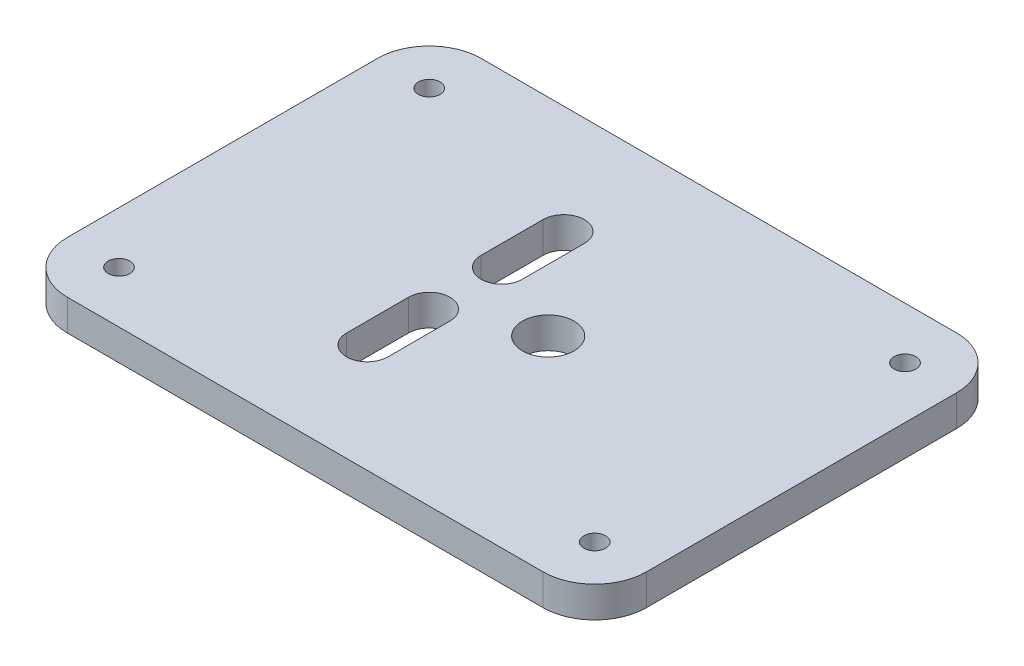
ISO-10303-21;
HEADER;
FILE_DESCRIPTION(('STEP AP214'),'2;1');
FILE_NAME('part.step','',(''),(''),'','','');
FILE_SCHEMA(('AUTOMOTIVE_DESIGN { 1 0 10303 214 1 1 1 1 }'));
ENDSEC;
DATA;
#1=APPLICATION_CONTEXT('core data for automotive mechanical design processes');
#2=APPLICATION_PROTOCOL_DEFINITION('international standard','automotive_design',2000,#1);
#3=PRODUCT_CONTEXT('',#1,'mechanical');
#4=PRODUCT('Part','Part','',(#3));
#5=PRODUCT_RELATED_PRODUCT_CATEGORY('part','',(#4));
#6=PRODUCT_DEFINITION_FORMATION('','',#4);
#7=PRODUCT_DEFINITION_CONTEXT('part definition',#1,'design');
#8=PRODUCT_DEFINITION('design','',#6,#7);
#9=PRODUCT_DEFINITION_SHAPE('','',#8);
#10=(LENGTH_UNIT() NAMED_UNIT(*) SI_UNIT(.MILLI.,.METRE.));
#11=(NAMED_UNIT(*) PLANE_ANGLE_UNIT() SI_UNIT($,.RADIAN.));
#12=(NAMED_UNIT(*) SI_UNIT($,.STERADIAN.) SOLID_ANGLE_UNIT());
#13=UNCERTAINTY_MEASURE_WITH_UNIT(LENGTH_MEASURE(1.E-05),#10,'distance_accuracy_value','');
#14=(GEOMETRIC_REPRESENTATION_CONTEXT(3) GLOBAL_UNCERTAINTY_ASSIGNED_CONTEXT((#13)) GLOBAL_UNIT_ASSIGNED_CONTEXT((#10,
#11,#12)) REPRESENTATION_CONTEXT('',''));
#15=CARTESIAN_POINT('',(0.,0.,0.));
#16=DIRECTION('',(0.,0.,1.));
#17=DIRECTION('',(1.,0.,0.));
#18=AXIS2_PLACEMENT_3D('',#15,#16,#17);
#19=CARTESIAN_POINT('',(102.,6.,-70.));
#20=DIRECTION('',(0.,1.,0.));
#21=DIRECTION('',(0.,0.,1.));
#22=AXIS2_PLACEMENT_3D('',#19,#20,#21);
#23=PLANE('',#22);
#24=CARTESIAN_POINT('',(10.,6.,-70.));
#25=DIRECTION('',(0.,1.,0.));
#26=DIRECTION('',(0.,0.,1.));
#27=AXIS2_PLACEMENT_3D('',#24,#25,#26);
#28=CIRCLE('',#27,2.09999999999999);
#29=CARTESIAN_POINT('',(10.,6.,-67.9));
#30=VERTEX_POINT('',#29);
#31=EDGE_CURVE('E474',#30,#30,#28,.T.);
#32=ORIENTED_EDGE('',*,*,#31,.F.);
#33=EDGE_LOOP('',(#32));
#34=FACE_BOUND('',#33,.T.);
#35=CARTESIAN_POINT('',(102.,6.,-70.));
#36=DIRECTION('',(0.,1.,0.));
#37=DIRECTION('',(0.,0.,1.));
#38=AXIS2_PLACEMENT_3D('',#35,#36,#37);
#39=CIRCLE('',#38,2.09999999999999);
#40=CARTESIAN_POINT('',(102.,6.,-67.9));
#41=VERTEX_POINT('',#40);
#42=EDGE_CURVE('E476',#41,#41,#39,.T.);
#43=ORIENTED_EDGE('',*,*,#42,.F.);
#44=EDGE_LOOP('',(#43));
#45=FACE_BOUND('',#44,.T.);
#46=CARTESIAN_POINT('',(102.,6.,-10.));
#47=DIRECTION('',(0.,1.,0.));
#48=DIRECTION('',(0.,0.,1.));
#49=AXIS2_PLACEMENT_3D('',#46,#47,#48);
#50=CIRCLE('',#49,2.09999999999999);
#51=CARTESIAN_POINT('',(102.,6.,-7.90000000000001));
#52=VERTEX_POINT('',#51);
#53=EDGE_CURVE('E484',#52,#52,#50,.T.);
#54=ORIENTED_EDGE('',*,*,#53,.F.);
#55=EDGE_LOOP('',(#54));
#56=FACE_BOUND('',#55,.T.);
#57=CARTESIAN_POINT('',(10.,6.,-10.));
#58=DIRECTION('',(0.,1.,0.));
#59=DIRECTION('',(0.,0.,1.));
#60=AXIS2_PLACEMENT_3D('',#57,#58,#59);
#61=CIRCLE('',#60,2.09999999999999);
#62=CARTESIAN_POINT('',(10.,6.,-7.90000000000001));
#63=VERTEX_POINT('',#62);
#64=EDGE_CURVE('E490',#63,#63,#61,.T.);
#65=ORIENTED_EDGE('',*,*,#64,.F.);
#66=EDGE_LOOP('',(#65));
#67=FACE_BOUND('',#66,.T.);
#68=DIRECTION('',(0.,0.,1.));
#69=VECTOR('',#68,1.);
#70=CARTESIAN_POINT('',(43.,6.,-47.));
#71=LINE('',#70,#69);
#72=CARTESIAN_POINT('',(43.,6.,-59.));
#73=VERTEX_POINT('',#72);
#74=CARTESIAN_POINT('',(43.,6.,-47.));
#75=VERTEX_POINT('',#74);
#76=EDGE_CURVE('E184',#73,#75,#71,.T.);
#77=ORIENTED_EDGE('',*,*,#76,.F.);
#78=CARTESIAN_POINT('',(47.,6.,-59.));
#79=DIRECTION('',(0.,1.,0.));
#80=DIRECTION('',(0.,0.,1.));
#81=AXIS2_PLACEMENT_3D('',#78,#79,#80);
#82=CIRCLE('',#81,4.);
#83=CARTESIAN_POINT('',(51.,6.,-59.));
#84=VERTEX_POINT('',#83);
#85=EDGE_CURVE('E182',#84,#73,#82,.T.);
#86=ORIENTED_EDGE('',*,*,#85,.F.);
#87=DIRECTION('',(0.,0.,-1.));
#88=VECTOR('',#87,1.);
#89=CARTESIAN_POINT('',(51.,6.,-59.));
#90=LINE('',#89,#88);
#91=CARTESIAN_POINT('',(51.,6.,-47.));
#92=VERTEX_POINT('',#91);
#93=EDGE_CURVE('E190',#92,#84,#90,.T.);
#94=ORIENTED_EDGE('',*,*,#93,.F.);
#95=CARTESIAN_POINT('',(47.,6.,-47.));
#96=DIRECTION('',(0.,1.,0.));
#97=DIRECTION('',(0.,0.,1.));
#98=AXIS2_PLACEMENT_3D('',#95,#96,#97);
#99=CIRCLE('',#98,4.);
#100=EDGE_CURVE('E187',#75,#92,#99,.T.);
#101=ORIENTED_EDGE('',*,*,#100,.F.);
#102=EDGE_LOOP('',(#77,#86,#94,#101));
#103=FACE_BOUND('',#102,.T.);
#104=CARTESIAN_POINT('',(102.,6.,-70.));
#105=DIRECTION('',(0.,1.,0.));
#106=DIRECTION('',(0.,0.,1.));
#107=AXIS2_PLACEMENT_3D('',#104,#105,#106);
#108=CIRCLE('',#107,9.99999999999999);
#109=CARTESIAN_POINT('',(112.,6.,-69.9999999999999));
#110=VERTEX_POINT('',#109);
#111=CARTESIAN_POINT('',(102.,6.,-80.));
#112=VERTEX_POINT('',#111);
#113=EDGE_CURVE('E219',#110,#112,#108,.T.);
#114=ORIENTED_EDGE('',*,*,#113,.T.);
#115=DIRECTION('',(-1.,0.,0.));
#116=VECTOR('',#115,1.);
#117=CARTESIAN_POINT('',(10.0000000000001,6.,-80.));
#118=LINE('',#117,#116);
#119=CARTESIAN_POINT('',(10.0000000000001,6.,-80.));
#120=VERTEX_POINT('',#119);
#121=EDGE_CURVE('E222',#112,#120,#118,.T.);
#122=ORIENTED_EDGE('',*,*,#121,.T.);
#123=CARTESIAN_POINT('',(10.,6.,-70.));
#124=DIRECTION('',(0.,1.,0.));
#125=DIRECTION('',(0.,0.,-1.));
#126=AXIS2_PLACEMENT_3D('',#123,#124,#125);
#127=CIRCLE('',#126,10.);
#128=CARTESIAN_POINT('',(0.,6.,-69.9999999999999));
#129=VERTEX_POINT('',#128);
#130=EDGE_CURVE('E225',#120,#129,#127,.T.);
#131=ORIENTED_EDGE('',*,*,#130,.T.);
#132=DIRECTION('',(0.,0.,1.));
#133=VECTOR('',#132,1.);
#134=CARTESIAN_POINT('',(0.,6.,-10.0000000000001));
#135=LINE('',#134,#133);
#136=CARTESIAN_POINT('',(0.,6.,-10.0000000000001));
#137=VERTEX_POINT('',#136);
#138=EDGE_CURVE('E227',#129,#137,#135,.T.);
#139=ORIENTED_EDGE('',*,*,#138,.T.);
#140=CARTESIAN_POINT('',(10.,6.,-10.));
#141=DIRECTION('',(0.,1.,0.));
#142=DIRECTION('',(0.,0.,-1.));
#143=AXIS2_PLACEMENT_3D('',#140,#141,#142);
#144=CIRCLE('',#143,10.);
#145=CARTESIAN_POINT('',(10.0000000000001,6.,0.));
#146=VERTEX_POINT('',#145);
#147=EDGE_CURVE('E229',#137,#146,#144,.T.);
#148=ORIENTED_EDGE('',*,*,#147,.T.);
#149=DIRECTION('',(1.,0.,0.));
#150=VECTOR('',#149,1.);
#151=CARTESIAN_POINT('',(10.0000000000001,6.,0.));
#152=LINE('',#151,#150);
#153=CARTESIAN_POINT('',(102.,6.,0.));
#154=VERTEX_POINT('',#153);
#155=EDGE_CURVE('E231',#146,#154,#152,.T.);
#156=ORIENTED_EDGE('',*,*,#155,.T.);
#157=CARTESIAN_POINT('',(102.,6.,-10.));
#158=DIRECTION('',(0.,1.,0.));
#159=DIRECTION('',(0.,0.,1.));
#160=AXIS2_PLACEMENT_3D('',#157,#158,#159);
#161=CIRCLE('',#160,10.);
#162=CARTESIAN_POINT('',(112.,6.,-10.0000000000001));
#163=VERTEX_POINT('',#162);
#164=EDGE_CURVE('E233',#154,#163,#161,.T.);
#165=ORIENTED_EDGE('',*,*,#164,.T.);
#166=DIRECTION('',(0.,0.,-1.));
#167=VECTOR('',#166,1.);
#168=CARTESIAN_POINT('',(112.,6.,-10.0000000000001));
#169=LINE('',#168,#167);
#170=EDGE_CURVE('E235',#163,#110,#169,.T.);
#171=ORIENTED_EDGE('',*,*,#170,.T.);
#172=EDGE_LOOP('',(#114,#122,#131,#139,#148,#156,#165,#171));
#173=FACE_BOUND('',#172,.T.);
#174=CARTESIAN_POINT('',(63.,6.,-40.));
#175=DIRECTION('',(0.,1.,0.));
#176=DIRECTION('',(0.,0.,1.));
#177=AXIS2_PLACEMENT_3D('',#174,#175,#176);
#178=CIRCLE('',#177,5.00000000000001);
#179=CARTESIAN_POINT('',(63.,6.,-35.));
#180=VERTEX_POINT('',#179);
#181=EDGE_CURVE('E213',#180,#180,#178,.T.);
#182=ORIENTED_EDGE('',*,*,#181,.F.);
#183=EDGE_LOOP('',(#182));
#184=FACE_BOUND('',#183,.T.);
#185=DIRECTION('',(0.,0.,1.));
#186=VECTOR('',#185,1.);
#187=CARTESIAN_POINT('',(43.,6.,-21.));
#188=LINE('',#187,#186);
#189=CARTESIAN_POINT('',(43.,6.,-33.));
#190=VERTEX_POINT('',#189);
#191=CARTESIAN_POINT('',(43.,6.,-21.));
#192=VERTEX_POINT('',#191);
#193=EDGE_CURVE('E152',#190,#192,#188,.T.);
#194=ORIENTED_EDGE('',*,*,#193,.F.);
#195=CARTESIAN_POINT('',(47.,6.,-33.));
#196=DIRECTION('',(0.,1.,0.));
#197=DIRECTION('',(0.,0.,1.));
#198=AXIS2_PLACEMENT_3D('',#195,#196,#197);
#199=CIRCLE('',#198,4.);
#200=CARTESIAN_POINT('',(51.,6.,-33.));
#201=VERTEX_POINT('',#200);
#202=EDGE_CURVE('E144',#201,#190,#199,.T.);
#203=ORIENTED_EDGE('',*,*,#202,.F.);
#204=DIRECTION('',(0.,0.,-1.));
#205=VECTOR('',#204,1.);
#206=CARTESIAN_POINT('',(51.,6.,-33.));
#207=LINE('',#206,#205);
#208=CARTESIAN_POINT('',(51.,6.,-21.));
#209=VERTEX_POINT('',#208);
#210=EDGE_CURVE('E166',#209,#201,#207,.T.);
#211=ORIENTED_EDGE('',*,*,#210,.F.);
#212=CARTESIAN_POINT('',(47.,6.,-21.));
#213=DIRECTION('',(0.,1.,0.));
#214=DIRECTION('',(0.,0.,1.));
#215=AXIS2_PLACEMENT_3D('',#212,#213,#214);
#216=CIRCLE('',#215,4.);
#217=EDGE_CURVE('E164',#192,#209,#216,.T.);
#218=ORIENTED_EDGE('',*,*,#217,.F.);
#219=EDGE_LOOP('',(#194,#203,#211,#218));
#220=FACE_BOUND('',#219,.T.);
#221=ADVANCED_FACE('F31',(#34,#45,#56,#67,#103,#173,#184,#220),#23,.T.);
#222=CARTESIAN_POINT('',(102.,0.,-70.));
#223=DIRECTION('',(0.,1.,0.));
#224=DIRECTION('',(0.,0.,1.));
#225=AXIS2_PLACEMENT_3D('',#222,#223,#224);
#226=PLANE('',#225);
#227=CARTESIAN_POINT('',(10.,0.,-70.));
#228=DIRECTION('',(0.,1.,0.));
#229=DIRECTION('',(0.,0.,1.));
#230=AXIS2_PLACEMENT_3D('',#227,#228,#229);
#231=CIRCLE('',#230,2.1);
#232=CARTESIAN_POINT('',(10.,0.,-67.9));
#233=VERTEX_POINT('',#232);
#234=EDGE_CURVE('E472',#233,#233,#231,.T.);
#235=ORIENTED_EDGE('',*,*,#234,.T.);
#236=EDGE_LOOP('',(#235));
#237=FACE_BOUND('',#236,.T.);
#238=CARTESIAN_POINT('',(102.,0.,-70.));
#239=DIRECTION('',(0.,1.,0.));
#240=DIRECTION('',(0.,0.,1.));
#241=AXIS2_PLACEMENT_3D('',#238,#239,#240);
#242=CIRCLE('',#241,2.09999999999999);
#243=CARTESIAN_POINT('',(102.,0.,-67.9));
#244=VERTEX_POINT('',#243);
#245=EDGE_CURVE('E481',#244,#244,#242,.T.);
#246=ORIENTED_EDGE('',*,*,#245,.T.);
#247=EDGE_LOOP('',(#246));
#248=FACE_BOUND('',#247,.T.);
#249=CARTESIAN_POINT('',(102.,0.,-10.));
#250=DIRECTION('',(0.,1.,0.));
#251=DIRECTION('',(0.,0.,1.));
#252=AXIS2_PLACEMENT_3D('',#249,#250,#251);
#253=CIRCLE('',#252,2.09999999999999);
#254=CARTESIAN_POINT('',(102.,0.,-7.90000000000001));
#255=VERTEX_POINT('',#254);
#256=EDGE_CURVE('E487',#255,#255,#253,.T.);
#257=ORIENTED_EDGE('',*,*,#256,.T.);
#258=EDGE_LOOP('',(#257));
#259=FACE_BOUND('',#258,.T.);
#260=CARTESIAN_POINT('',(10.,0.,-10.));
#261=DIRECTION('',(0.,1.,0.));
#262=DIRECTION('',(0.,0.,1.));
#263=AXIS2_PLACEMENT_3D('',#260,#261,#262);
#264=CIRCLE('',#263,2.1);
#265=CARTESIAN_POINT('',(10.,0.,-7.9));
#266=VERTEX_POINT('',#265);
#267=EDGE_CURVE('E172',#266,#266,#264,.T.);
#268=ORIENTED_EDGE('',*,*,#267,.T.);
#269=EDGE_LOOP('',(#268));
#270=FACE_BOUND('',#269,.T.);
#271=CARTESIAN_POINT('',(47.,0.,-59.));
#272=DIRECTION('',(0.,1.,0.));
#273=DIRECTION('',(0.,0.,1.));
#274=AXIS2_PLACEMENT_3D('',#271,#272,#273);
#275=CIRCLE('',#274,4.);
#276=CARTESIAN_POINT('',(51.,0.,-59.));
#277=VERTEX_POINT('',#276);
#278=CARTESIAN_POINT('',(43.,0.,-59.));
#279=VERTEX_POINT('',#278);
#280=EDGE_CURVE('E160',#277,#279,#275,.T.);
#281=ORIENTED_EDGE('',*,*,#280,.T.);
#282=DIRECTION('',(0.,0.,1.));
#283=VECTOR('',#282,1.);
#284=CARTESIAN_POINT('',(43.,0.,-47.));
#285=LINE('',#284,#283);
#286=CARTESIAN_POINT('',(43.,0.,-47.));
#287=VERTEX_POINT('',#286);
#288=EDGE_CURVE('E195',#279,#287,#285,.T.);
#289=ORIENTED_EDGE('',*,*,#288,.T.);
#290=CARTESIAN_POINT('',(47.,0.,-47.));
#291=DIRECTION('',(0.,1.,0.));
#292=DIRECTION('',(0.,0.,1.));
#293=AXIS2_PLACEMENT_3D('',#290,#291,#292);
#294=CIRCLE('',#293,4.);
#295=CARTESIAN_POINT('',(51.,0.,-47.));
#296=VERTEX_POINT('',#295);
#297=EDGE_CURVE('E198',#287,#296,#294,.T.);
#298=ORIENTED_EDGE('',*,*,#297,.T.);
#299=DIRECTION('',(0.,0.,-1.));
#300=VECTOR('',#299,1.);
#301=CARTESIAN_POINT('',(51.,0.,-59.));
#302=LINE('',#301,#300);
#303=EDGE_CURVE('E185',#296,#277,#302,.T.);
#304=ORIENTED_EDGE('',*,*,#303,.T.);
#305=EDGE_LOOP('',(#281,#289,#298,#304));
#306=FACE_BOUND('',#305,.T.);
#307=CARTESIAN_POINT('',(102.,0.,-70.));
#308=DIRECTION('',(0.,1.,0.));
#309=DIRECTION('',(0.,0.,1.));
#310=AXIS2_PLACEMENT_3D('',#307,#308,#309);
#311=CIRCLE('',#310,9.99999999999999);
#312=CARTESIAN_POINT('',(112.,0.,-69.9999999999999));
#313=VERTEX_POINT('',#312);
#314=CARTESIAN_POINT('',(102.,0.,-80.));
#315=VERTEX_POINT('',#314);
#316=EDGE_CURVE('E216',#313,#315,#311,.T.);
#317=ORIENTED_EDGE('',*,*,#316,.F.);
#318=DIRECTION('',(0.,0.,-1.));
#319=VECTOR('',#318,1.);
#320=CARTESIAN_POINT('',(112.,0.,-10.0000000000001));
#321=LINE('',#320,#319);
#322=CARTESIAN_POINT('',(112.,0.,-10.0000000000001));
#323=VERTEX_POINT('',#322);
#324=EDGE_CURVE('E223',#323,#313,#321,.T.);
#325=ORIENTED_EDGE('',*,*,#324,.F.);
#326=CARTESIAN_POINT('',(102.,0.,-10.));
#327=DIRECTION('',(0.,1.,0.));
#328=DIRECTION('',(0.,0.,1.));
#329=AXIS2_PLACEMENT_3D('',#326,#327,#328);
#330=CIRCLE('',#329,10.);
#331=CARTESIAN_POINT('',(102.,0.,0.));
#332=VERTEX_POINT('',#331);
#333=EDGE_CURVE('E250',#332,#323,#330,.T.);
#334=ORIENTED_EDGE('',*,*,#333,.F.);
#335=DIRECTION('',(1.,0.,0.));
#336=VECTOR('',#335,1.);
#337=CARTESIAN_POINT('',(10.0000000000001,0.,0.));
#338=LINE('',#337,#336);
#339=CARTESIAN_POINT('',(10.0000000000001,0.,0.));
#340=VERTEX_POINT('',#339);
#341=EDGE_CURVE('E248',#340,#332,#338,.T.);
#342=ORIENTED_EDGE('',*,*,#341,.F.);
#343=CARTESIAN_POINT('',(10.,0.,-10.));
#344=DIRECTION('',(0.,1.,0.));
#345=DIRECTION('',(0.,0.,-1.));
#346=AXIS2_PLACEMENT_3D('',#343,#344,#345);
#347=CIRCLE('',#346,10.);
#348=CARTESIAN_POINT('',(0.,0.,-10.0000000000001));
#349=VERTEX_POINT('',#348);
#350=EDGE_CURVE('E246',#349,#340,#347,.T.);
#351=ORIENTED_EDGE('',*,*,#350,.F.);
#352=DIRECTION('',(0.,0.,1.));
#353=VECTOR('',#352,1.);
#354=CARTESIAN_POINT('',(0.,0.,-10.0000000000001));
#355=LINE('',#354,#353);
#356=CARTESIAN_POINT('',(0.,0.,-69.9999999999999));
#357=VERTEX_POINT('',#356);
#358=EDGE_CURVE('E244',#357,#349,#355,.T.);
#359=ORIENTED_EDGE('',*,*,#358,.F.);
#360=CARTESIAN_POINT('',(10.,0.,-70.));
#361=DIRECTION('',(0.,1.,0.));
#362=DIRECTION('',(0.,0.,-1.));
#363=AXIS2_PLACEMENT_3D('',#360,#361,#362);
#364=CIRCLE('',#363,10.);
#365=CARTESIAN_POINT('',(10.0000000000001,0.,-80.));
#366=VERTEX_POINT('',#365);
#367=EDGE_CURVE('E242',#366,#357,#364,.T.);
#368=ORIENTED_EDGE('',*,*,#367,.F.);
#369=DIRECTION('',(-1.,0.,0.));
#370=VECTOR('',#369,1.);
#371=CARTESIAN_POINT('',(10.0000000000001,0.,-80.));
#372=LINE('',#371,#370);
#373=EDGE_CURVE('E240',#315,#366,#372,.T.);
#374=ORIENTED_EDGE('',*,*,#373,.F.);
#375=EDGE_LOOP('',(#317,#325,#334,#342,#351,#359,#368,#374));
#376=FACE_BOUND('',#375,.T.);
#377=CARTESIAN_POINT('',(63.,0.,-40.));
#378=DIRECTION('',(0.,1.,0.));
#379=DIRECTION('',(0.,0.,1.));
#380=AXIS2_PLACEMENT_3D('',#377,#378,#379);
#381=CIRCLE('',#380,5.00000000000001);
#382=CARTESIAN_POINT('',(63.,0.,-35.));
#383=VERTEX_POINT('',#382);
#384=EDGE_CURVE('E212',#383,#383,#381,.T.);
#385=ORIENTED_EDGE('',*,*,#384,.T.);
#386=EDGE_LOOP('',(#385));
#387=FACE_BOUND('',#386,.T.);
#388=CARTESIAN_POINT('',(47.,0.,-33.));
#389=DIRECTION('',(0.,1.,0.));
#390=DIRECTION('',(0.,0.,1.));
#391=AXIS2_PLACEMENT_3D('',#388,#389,#390);
#392=CIRCLE('',#391,4.);
#393=CARTESIAN_POINT('',(51.,0.,-33.));
#394=VERTEX_POINT('',#393);
#395=CARTESIAN_POINT('',(43.,0.,-33.));
#396=VERTEX_POINT('',#395);
#397=EDGE_CURVE('E54',#394,#396,#392,.T.);
#398=ORIENTED_EDGE('',*,*,#397,.T.);
#399=DIRECTION('',(0.,0.,1.));
#400=VECTOR('',#399,1.);
#401=CARTESIAN_POINT('',(43.,0.,-21.));
#402=LINE('',#401,#400);
#403=CARTESIAN_POINT('',(43.,0.,-21.));
#404=VERTEX_POINT('',#403);
#405=EDGE_CURVE('E159',#396,#404,#402,.T.);
#406=ORIENTED_EDGE('',*,*,#405,.T.);
#407=CARTESIAN_POINT('',(47.,0.,-21.));
#408=DIRECTION('',(0.,1.,0.));
#409=DIRECTION('',(0.,0.,1.));
#410=AXIS2_PLACEMENT_3D('',#407,#408,#409);
#411=CIRCLE('',#410,4.);
#412=CARTESIAN_POINT('',(51.,0.,-21.));
#413=VERTEX_POINT('',#412);
#414=EDGE_CURVE('E174',#404,#413,#411,.T.);
#415=ORIENTED_EDGE('',*,*,#414,.T.);
#416=DIRECTION('',(0.,0.,-1.));
#417=VECTOR('',#416,1.);
#418=CARTESIAN_POINT('',(51.,0.,-33.));
#419=LINE('',#418,#417);
#420=EDGE_CURVE('E153',#413,#394,#419,.T.);
#421=ORIENTED_EDGE('',*,*,#420,.T.);
#422=EDGE_LOOP('',(#398,#406,#415,#421));
#423=FACE_BOUND('',#422,.T.);
#424=ADVANCED_FACE('F280',(#237,#248,#259,#270,#306,#376,#387,#423),#226,.F.);
#425=CARTESIAN_POINT('',(102.,6.,-70.));
#426=DIRECTION('',(0.,-1.,0.));
#427=DIRECTION('',(0.,0.,-1.));
#428=AXIS2_PLACEMENT_3D('',#425,#426,#427);
#429=CYLINDRICAL_SURFACE('',#428,9.99999999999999);
#430=ORIENTED_EDGE('',*,*,#316,.T.);
#431=DIRECTION('',(0.,-1.,0.));
#432=VECTOR('',#431,1.);
#433=CARTESIAN_POINT('',(102.,6.,-80.));
#434=LINE('',#433,#432);
#435=EDGE_CURVE('E11',#112,#315,#434,.T.);
#436=ORIENTED_EDGE('',*,*,#435,.F.);
#437=ORIENTED_EDGE('',*,*,#113,.F.);
#438=DIRECTION('',(0.,-1.,0.));
#439=VECTOR('',#438,1.);
#440=CARTESIAN_POINT('',(112.,6.,-69.9999999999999));
#441=LINE('',#440,#439);
#442=EDGE_CURVE('E237',#110,#313,#441,.T.);
#443=ORIENTED_EDGE('',*,*,#442,.T.);
#444=EDGE_LOOP('',(#430,#436,#437,#443));
#445=FACE_BOUND('',#444,.T.);
#446=ADVANCED_FACE('F33',(#445),#429,.T.);
#447=CARTESIAN_POINT('',(10.0000000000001,6.,-80.));
#448=DIRECTION('',(0.,0.,1.));
#449=DIRECTION('',(1.,0.,0.));
#450=AXIS2_PLACEMENT_3D('',#447,#448,#449);
#451=PLANE('',#450);
#452=ORIENTED_EDGE('',*,*,#373,.T.);
#453=DIRECTION('',(0.,-1.,0.));
#454=VECTOR('',#453,1.);
#455=CARTESIAN_POINT('',(10.0000000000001,6.,-80.));
#456=LINE('',#455,#454);
#457=EDGE_CURVE('E39',#120,#366,#456,.T.);
#458=ORIENTED_EDGE('',*,*,#457,.F.);
#459=ORIENTED_EDGE('',*,*,#121,.F.);
#460=ORIENTED_EDGE('',*,*,#435,.T.);
#461=EDGE_LOOP('',(#452,#458,#459,#460));
#462=FACE_BOUND('',#461,.T.);
#463=ADVANCED_FACE('F298',(#462),#451,.F.);
#464=CARTESIAN_POINT('',(10.,6.,-70.));
#465=DIRECTION('',(0.,-1.,0.));
#466=DIRECTION('',(0.,0.,-1.));
#467=AXIS2_PLACEMENT_3D('',#464,#465,#466);
#468=CYLINDRICAL_SURFACE('',#467,10.);
#469=ORIENTED_EDGE('',*,*,#367,.T.);
#470=DIRECTION('',(0.,-1.,0.));
#471=VECTOR('',#470,1.);
#472=CARTESIAN_POINT('',(0.,6.,-69.9999999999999));
#473=LINE('',#472,#471);
#474=EDGE_CURVE('E267',#129,#357,#473,.T.);
#475=ORIENTED_EDGE('',*,*,#474,.F.);
#476=ORIENTED_EDGE('',*,*,#130,.F.);
#477=ORIENTED_EDGE('',*,*,#457,.T.);
#478=EDGE_LOOP('',(#469,#475,#476,#477));
#479=FACE_BOUND('',#478,.T.);
#480=ADVANCED_FACE('F274',(#479),#468,.T.);
#481=CARTESIAN_POINT('',(0.,6.,-10.0000000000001));
#482=DIRECTION('',(1.,0.,0.));
#483=DIRECTION('',(0.,0.,-1.));
#484=AXIS2_PLACEMENT_3D('',#481,#482,#483);
#485=PLANE('',#484);
#486=ORIENTED_EDGE('',*,*,#358,.T.);
#487=DIRECTION('',(0.,-1.,0.));
#488=VECTOR('',#487,1.);
#489=CARTESIAN_POINT('',(0.,6.,-10.0000000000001));
#490=LINE('',#489,#488);
#491=EDGE_CURVE('E264',#137,#349,#490,.T.);
#492=ORIENTED_EDGE('',*,*,#491,.F.);
#493=ORIENTED_EDGE('',*,*,#138,.F.);
#494=ORIENTED_EDGE('',*,*,#474,.T.);
#495=EDGE_LOOP('',(#486,#492,#493,#494));
#496=FACE_BOUND('',#495,.T.);
#497=ADVANCED_FACE('F286',(#496),#485,.F.);
#498=CARTESIAN_POINT('',(10.,6.,-10.));
#499=DIRECTION('',(0.,-1.,0.));
#500=DIRECTION('',(0.,0.,-1.));
#501=AXIS2_PLACEMENT_3D('',#498,#499,#500);
#502=CYLINDRICAL_SURFACE('',#501,10.);
#503=ORIENTED_EDGE('',*,*,#350,.T.);
#504=DIRECTION('',(0.,-1.,0.));
#505=VECTOR('',#504,1.);
#506=CARTESIAN_POINT('',(10.0000000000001,6.,0.));
#507=LINE('',#506,#505);
#508=EDGE_CURVE('E261',#146,#340,#507,.T.);
#509=ORIENTED_EDGE('',*,*,#508,.F.);
#510=ORIENTED_EDGE('',*,*,#147,.F.);
#511=ORIENTED_EDGE('',*,*,#491,.T.);
#512=EDGE_LOOP('',(#503,#509,#510,#511));
#513=FACE_BOUND('',#512,.T.);
#514=ADVANCED_FACE('F290',(#513),#502,.T.);
#515=CARTESIAN_POINT('',(10.0000000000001,6.,0.));
#516=DIRECTION('',(0.,0.,-1.));
#517=DIRECTION('',(-1.,0.,0.));
#518=AXIS2_PLACEMENT_3D('',#515,#516,#517);
#519=PLANE('',#518);
#520=ORIENTED_EDGE('',*,*,#341,.T.);
#521=DIRECTION('',(0.,-1.,0.));
#522=VECTOR('',#521,1.);
#523=CARTESIAN_POINT('',(102.,6.,0.));
#524=LINE('',#523,#522);
#525=EDGE_CURVE('E258',#154,#332,#524,.T.);
#526=ORIENTED_EDGE('',*,*,#525,.F.);
#527=ORIENTED_EDGE('',*,*,#155,.F.);
#528=ORIENTED_EDGE('',*,*,#508,.T.);
#529=EDGE_LOOP('',(#520,#526,#527,#528));
#530=FACE_BOUND('',#529,.T.);
#531=ADVANCED_FACE('F311',(#530),#519,.F.);
#532=CARTESIAN_POINT('',(102.,6.,-10.));
#533=DIRECTION('',(0.,-1.,0.));
#534=DIRECTION('',(0.,0.,-1.));
#535=AXIS2_PLACEMENT_3D('',#532,#533,#534);
#536=CYLINDRICAL_SURFACE('',#535,10.);
#537=ORIENTED_EDGE('',*,*,#333,.T.);
#538=DIRECTION('',(0.,-1.,0.));
#539=VECTOR('',#538,1.);
#540=CARTESIAN_POINT('',(112.,6.,-10.0000000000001));
#541=LINE('',#540,#539);
#542=EDGE_CURVE('E255',#163,#323,#541,.T.);
#543=ORIENTED_EDGE('',*,*,#542,.F.);
#544=ORIENTED_EDGE('',*,*,#164,.F.);
#545=ORIENTED_EDGE('',*,*,#525,.T.);
#546=EDGE_LOOP('',(#537,#543,#544,#545));
#547=FACE_BOUND('',#546,.T.);
#548=ADVANCED_FACE('F309',(#547),#536,.T.);
#549=CARTESIAN_POINT('',(112.,6.,-10.0000000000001));
#550=DIRECTION('',(-1.,0.,0.));
#551=DIRECTION('',(0.,0.,1.));
#552=AXIS2_PLACEMENT_3D('',#549,#550,#551);
#553=PLANE('',#552);
#554=ORIENTED_EDGE('',*,*,#324,.T.);
#555=ORIENTED_EDGE('',*,*,#442,.F.);
#556=ORIENTED_EDGE('',*,*,#170,.F.);
#557=ORIENTED_EDGE('',*,*,#542,.T.);
#558=EDGE_LOOP('',(#554,#555,#556,#557));
#559=FACE_BOUND('',#558,.T.);
#560=ADVANCED_FACE('F304',(#559),#553,.F.);
#561=CARTESIAN_POINT('',(63.,6.,-40.));
#562=DIRECTION('',(0.,-1.,0.));
#563=DIRECTION('',(0.,0.,-1.));
#564=AXIS2_PLACEMENT_3D('',#561,#562,#563);
#565=CYLINDRICAL_SURFACE('',#564,5.00000000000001);
#566=ORIENTED_EDGE('',*,*,#181,.T.);
#567=EDGE_LOOP('',(#566));
#568=FACE_BOUND('',#567,.T.);
#569=ORIENTED_EDGE('',*,*,#384,.F.);
#570=EDGE_LOOP('',(#569));
#571=FACE_BOUND('',#570,.T.);
#572=ADVANCED_FACE('F331',(#568,#571),#565,.F.);
#573=CARTESIAN_POINT('',(47.,6.,-59.));
#574=DIRECTION('',(0.,-1.,0.));
#575=DIRECTION('',(0.,0.,-1.));
#576=AXIS2_PLACEMENT_3D('',#573,#574,#575);
#577=CYLINDRICAL_SURFACE('',#576,4.);
#578=ORIENTED_EDGE('',*,*,#280,.F.);
#579=DIRECTION('',(0.,-1.,0.));
#580=VECTOR('',#579,1.);
#581=CARTESIAN_POINT('',(51.,6.,-59.));
#582=LINE('',#581,#580);
#583=EDGE_CURVE('E192',#84,#277,#582,.T.);
#584=ORIENTED_EDGE('',*,*,#583,.F.);
#585=ORIENTED_EDGE('',*,*,#85,.T.);
#586=DIRECTION('',(0.,-1.,0.));
#587=VECTOR('',#586,1.);
#588=CARTESIAN_POINT('',(43.,6.,-59.));
#589=LINE('',#588,#587);
#590=EDGE_CURVE('E209',#73,#279,#589,.T.);
#591=ORIENTED_EDGE('',*,*,#590,.T.);
#592=EDGE_LOOP('',(#578,#584,#585,#591));
#593=FACE_BOUND('',#592,.T.);
#594=ADVANCED_FACE('F338',(#593),#577,.F.);
#595=CARTESIAN_POINT('',(43.,6.,-47.));
#596=DIRECTION('',(1.,0.,0.));
#597=DIRECTION('',(0.,0.,-1.));
#598=AXIS2_PLACEMENT_3D('',#595,#596,#597);
#599=PLANE('',#598);
#600=ORIENTED_EDGE('',*,*,#288,.F.);
#601=ORIENTED_EDGE('',*,*,#590,.F.);
#602=ORIENTED_EDGE('',*,*,#76,.T.);
#603=DIRECTION('',(0.,-1.,0.));
#604=VECTOR('',#603,1.);
#605=CARTESIAN_POINT('',(43.,6.,-47.));
#606=LINE('',#605,#604);
#607=EDGE_CURVE('E207',#75,#287,#606,.T.);
#608=ORIENTED_EDGE('',*,*,#607,.T.);
#609=EDGE_LOOP('',(#600,#601,#602,#608));
#610=FACE_BOUND('',#609,.T.);
#611=ADVANCED_FACE('F343',(#610),#599,.T.);
#612=CARTESIAN_POINT('',(47.,6.,-47.));
#613=DIRECTION('',(0.,-1.,0.));
#614=DIRECTION('',(0.,0.,-1.));
#615=AXIS2_PLACEMENT_3D('',#612,#613,#614);
#616=CYLINDRICAL_SURFACE('',#615,4.);
#617=ORIENTED_EDGE('',*,*,#297,.F.);
#618=ORIENTED_EDGE('',*,*,#607,.F.);
#619=ORIENTED_EDGE('',*,*,#100,.T.);
#620=DIRECTION('',(0.,-1.,0.));
#621=VECTOR('',#620,1.);
#622=CARTESIAN_POINT('',(51.,6.,-47.));
#623=LINE('',#622,#621);
#624=EDGE_CURVE('E205',#92,#296,#623,.T.);
#625=ORIENTED_EDGE('',*,*,#624,.T.);
#626=EDGE_LOOP('',(#617,#618,#619,#625));
#627=FACE_BOUND('',#626,.T.);
#628=ADVANCED_FACE('F373',(#627),#616,.F.);
#629=CARTESIAN_POINT('',(51.,6.,-59.));
#630=DIRECTION('',(-1.,0.,0.));
#631=DIRECTION('',(0.,0.,1.));
#632=AXIS2_PLACEMENT_3D('',#629,#630,#631);
#633=PLANE('',#632);
#634=ORIENTED_EDGE('',*,*,#303,.F.);
#635=ORIENTED_EDGE('',*,*,#624,.F.);
#636=ORIENTED_EDGE('',*,*,#93,.T.);
#637=ORIENTED_EDGE('',*,*,#583,.T.);
#638=EDGE_LOOP('',(#634,#635,#636,#637));
#639=FACE_BOUND('',#638,.T.);
#640=ADVANCED_FACE('F370',(#639),#633,.T.);
#641=CARTESIAN_POINT('',(47.,6.,-33.));
#642=DIRECTION('',(0.,-1.,0.));
#643=DIRECTION('',(0.,0.,-1.));
#644=AXIS2_PLACEMENT_3D('',#641,#642,#643);
#645=CYLINDRICAL_SURFACE('',#644,4.);
#646=ORIENTED_EDGE('',*,*,#397,.F.);
#647=DIRECTION('',(0.,-1.,0.));
#648=VECTOR('',#647,1.);
#649=CARTESIAN_POINT('',(51.,6.,-33.));
#650=LINE('',#649,#648);
#651=EDGE_CURVE('E148',#201,#394,#650,.T.);
#652=ORIENTED_EDGE('',*,*,#651,.F.);
#653=ORIENTED_EDGE('',*,*,#202,.T.);
#654=DIRECTION('',(0.,-1.,0.));
#655=VECTOR('',#654,1.);
#656=CARTESIAN_POINT('',(43.,6.,-33.));
#657=LINE('',#656,#655);
#658=EDGE_CURVE('E147',#190,#396,#657,.T.);
#659=ORIENTED_EDGE('',*,*,#658,.T.);
#660=EDGE_LOOP('',(#646,#652,#653,#659));
#661=FACE_BOUND('',#660,.T.);
#662=ADVANCED_FACE('F146',(#661),#645,.F.);
#663=CARTESIAN_POINT('',(43.,6.,-21.));
#664=DIRECTION('',(1.,0.,0.));
#665=DIRECTION('',(0.,0.,-1.));
#666=AXIS2_PLACEMENT_3D('',#663,#664,#665);
#667=PLANE('',#666);
#668=ORIENTED_EDGE('',*,*,#405,.F.);
#669=ORIENTED_EDGE('',*,*,#658,.F.);
#670=ORIENTED_EDGE('',*,*,#193,.T.);
#671=DIRECTION('',(0.,-1.,0.));
#672=VECTOR('',#671,1.);
#673=CARTESIAN_POINT('',(43.,6.,-21.));
#674=LINE('',#673,#672);
#675=EDGE_CURVE('E161',#192,#404,#674,.T.);
#676=ORIENTED_EDGE('',*,*,#675,.T.);
#677=EDGE_LOOP('',(#668,#669,#670,#676));
#678=FACE_BOUND('',#677,.T.);
#679=ADVANCED_FACE('F156',(#678),#667,.T.);
#680=CARTESIAN_POINT('',(47.,6.,-21.));
#681=DIRECTION('',(0.,-1.,0.));
#682=DIRECTION('',(0.,0.,-1.));
#683=AXIS2_PLACEMENT_3D('',#680,#681,#682);
#684=CYLINDRICAL_SURFACE('',#683,4.);
#685=ORIENTED_EDGE('',*,*,#414,.F.);
#686=ORIENTED_EDGE('',*,*,#675,.F.);
#687=ORIENTED_EDGE('',*,*,#217,.T.);
#688=DIRECTION('',(0.,-1.,0.));
#689=VECTOR('',#688,1.);
#690=CARTESIAN_POINT('',(51.,6.,-21.));
#691=LINE('',#690,#689);
#692=EDGE_CURVE('E46',#209,#413,#691,.T.);
#693=ORIENTED_EDGE('',*,*,#692,.T.);
#694=EDGE_LOOP('',(#685,#686,#687,#693));
#695=FACE_BOUND('',#694,.T.);
#696=ADVANCED_FACE('F353',(#695),#684,.F.);
#697=CARTESIAN_POINT('',(51.,6.,-33.));
#698=DIRECTION('',(-1.,0.,0.));
#699=DIRECTION('',(0.,0.,1.));
#700=AXIS2_PLACEMENT_3D('',#697,#698,#699);
#701=PLANE('',#700);
#702=ORIENTED_EDGE('',*,*,#420,.F.);
#703=ORIENTED_EDGE('',*,*,#692,.F.);
#704=ORIENTED_EDGE('',*,*,#210,.T.);
#705=ORIENTED_EDGE('',*,*,#651,.T.);
#706=EDGE_LOOP('',(#702,#703,#704,#705));
#707=FACE_BOUND('',#706,.T.);
#708=ADVANCED_FACE('F350',(#707),#701,.T.);
#709=CARTESIAN_POINT('',(10.,6.,-10.));
#710=DIRECTION('',(0.,1.,0.));
#711=DIRECTION('',(0.,0.,1.));
#712=AXIS2_PLACEMENT_3D('',#709,#710,#711);
#713=CYLINDRICAL_SURFACE('',#712,2.09999999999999);
#714=ORIENTED_EDGE('',*,*,#267,.F.);
#715=EDGE_LOOP('',(#714));
#716=FACE_BOUND('',#715,.T.);
#717=ORIENTED_EDGE('',*,*,#64,.T.);
#718=EDGE_LOOP('',(#717));
#719=FACE_BOUND('',#718,.T.);
#720=ADVANCED_FACE('F352',(#716,#719),#713,.F.);
#721=CARTESIAN_POINT('',(102.,6.,-10.));
#722=DIRECTION('',(0.,1.,0.));
#723=DIRECTION('',(0.,0.,1.));
#724=AXIS2_PLACEMENT_3D('',#721,#722,#723);
#725=CYLINDRICAL_SURFACE('',#724,2.09999999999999);
#726=ORIENTED_EDGE('',*,*,#256,.F.);
#727=EDGE_LOOP('',(#726));
#728=FACE_BOUND('',#727,.T.);
#729=ORIENTED_EDGE('',*,*,#53,.T.);
#730=EDGE_LOOP('',(#729));
#731=FACE_BOUND('',#730,.T.);
#732=ADVANCED_FACE('F359',(#728,#731),#725,.F.);
#733=CARTESIAN_POINT('',(102.,6.,-70.));
#734=DIRECTION('',(0.,1.,0.));
#735=DIRECTION('',(0.,0.,1.));
#736=AXIS2_PLACEMENT_3D('',#733,#734,#735);
#737=CYLINDRICAL_SURFACE('',#736,2.09999999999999);
#738=ORIENTED_EDGE('',*,*,#245,.F.);
#739=EDGE_LOOP('',(#738));
#740=FACE_BOUND('',#739,.T.);
#741=ORIENTED_EDGE('',*,*,#42,.T.);
#742=EDGE_LOOP('',(#741));
#743=FACE_BOUND('',#742,.T.);
#744=ADVANCED_FACE('F446',(#740,#743),#737,.F.);
#745=CARTESIAN_POINT('',(10.,6.,-70.));
#746=DIRECTION('',(0.,1.,0.));
#747=DIRECTION('',(0.,0.,1.));
#748=AXIS2_PLACEMENT_3D('',#745,#746,#747);
#749=CYLINDRICAL_SURFACE('',#748,2.09999999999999);
#750=ORIENTED_EDGE('',*,*,#234,.F.);
#751=EDGE_LOOP('',(#750));
#752=FACE_BOUND('',#751,.T.);
#753=ORIENTED_EDGE('',*,*,#31,.T.);
#754=EDGE_LOOP('',(#753));
#755=FACE_BOUND('',#754,.T.);
#756=ADVANCED_FACE('F455',(#752,#755),#749,.F.);
#757=CLOSED_SHELL('',(#221,#424,#446,#463,#480,#497,#514,#531,#548,#560,#572,#594,#611,#628,
#640,#662,#679,#696,#708,#720,#732,#744,#756));
#758=MANIFOLD_SOLID_BREP('B2',#757);
#759=ADVANCED_BREP_SHAPE_REPRESENTATION('',(#18,#758),#14);
#760=SHAPE_DEFINITION_REPRESENTATION(#9,#759);
ENDSEC;
END-ISO-10303-21;
